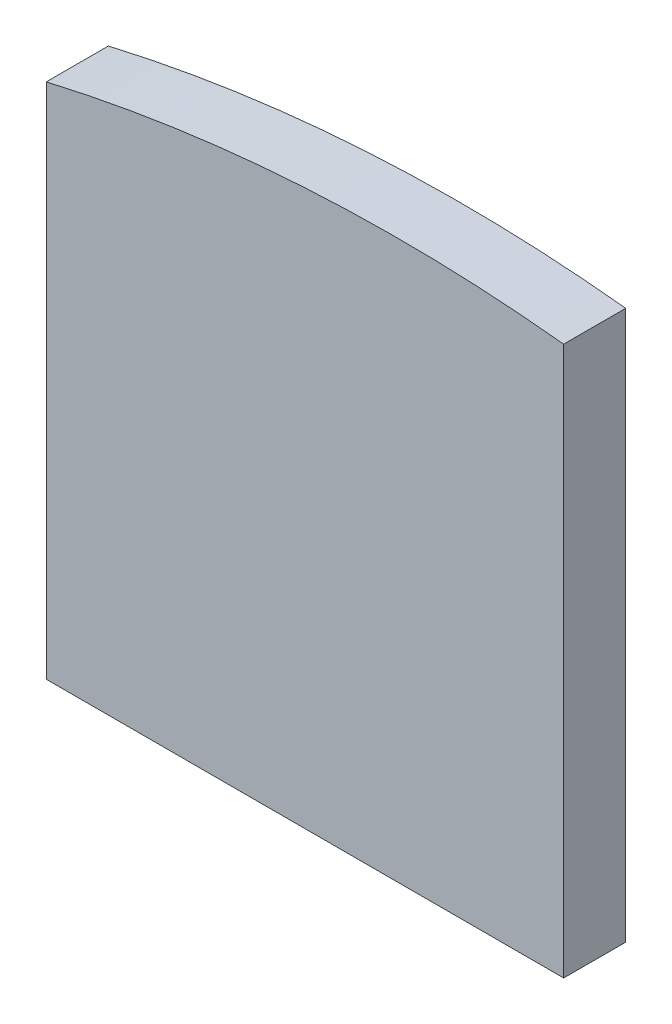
ISO-10303-21;
HEADER;
FILE_DESCRIPTION(('STEP AP214'),'2;1');
FILE_NAME('part.step','',(''),(''),'','','');
FILE_SCHEMA(('AUTOMOTIVE_DESIGN { 1 0 10303 214 1 1 1 1 }'));
ENDSEC;
DATA;
#1=APPLICATION_CONTEXT('core data for automotive mechanical design processes');
#2=APPLICATION_PROTOCOL_DEFINITION('international standard','automotive_design',2000,#1);
#3=PRODUCT_CONTEXT('',#1,'mechanical');
#4=PRODUCT('Part','Part','',(#3));
#5=PRODUCT_RELATED_PRODUCT_CATEGORY('part','',(#4));
#6=PRODUCT_DEFINITION_FORMATION('','',#4);
#7=PRODUCT_DEFINITION_CONTEXT('part definition',#1,'design');
#8=PRODUCT_DEFINITION('design','',#6,#7);
#9=PRODUCT_DEFINITION_SHAPE('','',#8);
#10=(LENGTH_UNIT() NAMED_UNIT(*) SI_UNIT(.MILLI.,.METRE.));
#11=(NAMED_UNIT(*) PLANE_ANGLE_UNIT() SI_UNIT($,.RADIAN.));
#12=(NAMED_UNIT(*) SI_UNIT($,.STERADIAN.) SOLID_ANGLE_UNIT());
#13=UNCERTAINTY_MEASURE_WITH_UNIT(LENGTH_MEASURE(1.E-05),#10,'distance_accuracy_value','');
#14=(GEOMETRIC_REPRESENTATION_CONTEXT(3) GLOBAL_UNCERTAINTY_ASSIGNED_CONTEXT((#13)) GLOBAL_UNIT_ASSIGNED_CONTEXT((#10,
#11,#12)) REPRESENTATION_CONTEXT('',''));
#15=CARTESIAN_POINT('',(0.,0.,0.));
#16=DIRECTION('',(0.,0.,1.));
#17=DIRECTION('',(1.,0.,0.));
#18=AXIS2_PLACEMENT_3D('',#15,#16,#17);
#19=CARTESIAN_POINT('',(0.,0.,12.));
#20=DIRECTION('',(0.,0.,-1.));
#21=DIRECTION('',(-1.,0.,0.));
#22=AXIS2_PLACEMENT_3D('',#19,#20,#21);
#23=CYLINDRICAL_SURFACE('',#22,300.);
#24=CARTESIAN_POINT('',(0.,0.,0.));
#25=DIRECTION('',(0.,0.,1.));
#26=DIRECTION('',(-1.,0.,0.));
#27=AXIS2_PLACEMENT_3D('',#24,#25,#26);
#28=CIRCLE('',#27,300.);
#29=CARTESIAN_POINT('',(32.,298.288451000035,0.));
#30=VERTEX_POINT('',#29);
#31=CARTESIAN_POINT('',(-68.,292.191717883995,0.));
#32=VERTEX_POINT('',#31);
#33=EDGE_CURVE('E72',#30,#32,#28,.T.);
#34=ORIENTED_EDGE('',*,*,#33,.T.);
#35=DIRECTION('',(0.,0.,-1.));
#36=VECTOR('',#35,1.);
#37=CARTESIAN_POINT('',(-68.,292.191717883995,12.));
#38=LINE('',#37,#36);
#39=CARTESIAN_POINT('',(-68.,292.191717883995,12.));
#40=VERTEX_POINT('',#39);
#41=EDGE_CURVE('E11',#40,#32,#38,.T.);
#42=ORIENTED_EDGE('',*,*,#41,.F.);
#43=CARTESIAN_POINT('',(0.,0.,12.));
#44=DIRECTION('',(0.,0.,1.));
#45=DIRECTION('',(-1.,0.,0.));
#46=AXIS2_PLACEMENT_3D('',#43,#44,#45);
#47=CIRCLE('',#46,300.);
#48=CARTESIAN_POINT('',(32.,298.288451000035,12.));
#49=VERTEX_POINT('',#48);
#50=EDGE_CURVE('E90',#49,#40,#47,.T.);
#51=ORIENTED_EDGE('',*,*,#50,.F.);
#52=DIRECTION('',(0.,0.,-1.));
#53=VECTOR('',#52,1.);
#54=CARTESIAN_POINT('',(32.,298.288451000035,12.));
#55=LINE('',#54,#53);
#56=EDGE_CURVE('E84',#49,#30,#55,.T.);
#57=ORIENTED_EDGE('',*,*,#56,.T.);
#58=EDGE_LOOP('',(#34,#42,#51,#57));
#59=FACE_BOUND('',#58,.T.);
#60=ADVANCED_FACE('F28',(#59),#23,.T.);
#61=CARTESIAN_POINT('',(-68.,292.191717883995,12.));
#62=DIRECTION('',(1.,0.,0.));
#63=DIRECTION('',(0.,1.,0.));
#64=AXIS2_PLACEMENT_3D('',#61,#62,#63);
#65=PLANE('',#64);
#66=DIRECTION('',(0.,-1.,0.));
#67=VECTOR('',#66,1.);
#68=CARTESIAN_POINT('',(-68.,292.191717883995,0.));
#69=LINE('',#68,#67);
#70=CARTESIAN_POINT('',(-68.,192.191717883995,0.));
#71=VERTEX_POINT('',#70);
#72=EDGE_CURVE('E68',#32,#71,#69,.T.);
#73=ORIENTED_EDGE('',*,*,#72,.T.);
#74=DIRECTION('',(0.,0.,-1.));
#75=VECTOR('',#74,1.);
#76=CARTESIAN_POINT('',(-68.,192.191717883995,12.));
#77=LINE('',#76,#75);
#78=CARTESIAN_POINT('',(-68.,192.191717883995,12.));
#79=VERTEX_POINT('',#78);
#80=EDGE_CURVE('E35',#79,#71,#77,.T.);
#81=ORIENTED_EDGE('',*,*,#80,.F.);
#82=DIRECTION('',(0.,-1.,0.));
#83=VECTOR('',#82,1.);
#84=CARTESIAN_POINT('',(-68.,292.191717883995,12.));
#85=LINE('',#84,#83);
#86=EDGE_CURVE('E80',#40,#79,#85,.T.);
#87=ORIENTED_EDGE('',*,*,#86,.F.);
#88=ORIENTED_EDGE('',*,*,#41,.T.);
#89=EDGE_LOOP('',(#73,#81,#87,#88));
#90=FACE_BOUND('',#89,.T.);
#91=ADVANCED_FACE('F79',(#90),#65,.F.);
#92=CARTESIAN_POINT('',(-68.,192.191717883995,12.));
#93=DIRECTION('',(0.,1.,0.));
#94=DIRECTION('',(0.,0.,1.));
#95=AXIS2_PLACEMENT_3D('',#92,#93,#94);
#96=PLANE('',#95);
#97=DIRECTION('',(1.,0.,0.));
#98=VECTOR('',#97,1.);
#99=CARTESIAN_POINT('',(-68.,192.191717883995,0.));
#100=LINE('',#99,#98);
#101=CARTESIAN_POINT('',(32.,192.191717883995,0.));
#102=VERTEX_POINT('',#101);
#103=EDGE_CURVE('E73',#71,#102,#100,.T.);
#104=ORIENTED_EDGE('',*,*,#103,.T.);
#105=DIRECTION('',(0.,0.,-1.));
#106=VECTOR('',#105,1.);
#107=CARTESIAN_POINT('',(32.,192.191717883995,12.));
#108=LINE('',#107,#106);
#109=CARTESIAN_POINT('',(32.,192.191717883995,12.));
#110=VERTEX_POINT('',#109);
#111=EDGE_CURVE('E96',#110,#102,#108,.T.);
#112=ORIENTED_EDGE('',*,*,#111,.F.);
#113=DIRECTION('',(1.,0.,0.));
#114=VECTOR('',#113,1.);
#115=CARTESIAN_POINT('',(-68.,192.191717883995,12.));
#116=LINE('',#115,#114);
#117=EDGE_CURVE('E47',#79,#110,#116,.T.);
#118=ORIENTED_EDGE('',*,*,#117,.F.);
#119=ORIENTED_EDGE('',*,*,#80,.T.);
#120=EDGE_LOOP('',(#104,#112,#118,#119));
#121=FACE_BOUND('',#120,.T.);
#122=ADVANCED_FACE('F99',(#121),#96,.F.);
#123=CARTESIAN_POINT('',(32.,192.191717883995,12.));
#124=DIRECTION('',(-1.,0.,0.));
#125=DIRECTION('',(0.,0.,1.));
#126=AXIS2_PLACEMENT_3D('',#123,#124,#125);
#127=PLANE('',#126);
#128=DIRECTION('',(0.,1.,0.));
#129=VECTOR('',#128,1.);
#130=CARTESIAN_POINT('',(32.,192.191717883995,0.));
#131=LINE('',#130,#129);
#132=EDGE_CURVE('E88',#102,#30,#131,.T.);
#133=ORIENTED_EDGE('',*,*,#132,.T.);
#134=ORIENTED_EDGE('',*,*,#56,.F.);
#135=DIRECTION('',(0.,1.,0.));
#136=VECTOR('',#135,1.);
#137=CARTESIAN_POINT('',(32.,192.191717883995,12.));
#138=LINE('',#137,#136);
#139=EDGE_CURVE('E42',#110,#49,#138,.T.);
#140=ORIENTED_EDGE('',*,*,#139,.F.);
#141=ORIENTED_EDGE('',*,*,#111,.T.);
#142=EDGE_LOOP('',(#133,#134,#140,#141));
#143=FACE_BOUND('',#142,.T.);
#144=ADVANCED_FACE('F101',(#143),#127,.F.);
#145=CARTESIAN_POINT('',(0.,0.,12.));
#146=DIRECTION('',(0.,0.,-1.));
#147=DIRECTION('',(-1.,0.,0.));
#148=AXIS2_PLACEMENT_3D('',#145,#146,#147);
#149=PLANE('',#148);
#150=ORIENTED_EDGE('',*,*,#50,.T.);
#151=ORIENTED_EDGE('',*,*,#86,.T.);
#152=ORIENTED_EDGE('',*,*,#117,.T.);
#153=ORIENTED_EDGE('',*,*,#139,.T.);
#154=EDGE_LOOP('',(#150,#151,#152,#153));
#155=FACE_BOUND('',#154,.T.);
#156=ADVANCED_FACE('F102',(#155),#149,.F.);
#157=CARTESIAN_POINT('',(0.,0.,0.));
#158=DIRECTION('',(0.,0.,-1.));
#159=DIRECTION('',(-1.,0.,0.));
#160=AXIS2_PLACEMENT_3D('',#157,#158,#159);
#161=PLANE('',#160);
#162=ORIENTED_EDGE('',*,*,#33,.F.);
#163=ORIENTED_EDGE('',*,*,#132,.F.);
#164=ORIENTED_EDGE('',*,*,#103,.F.);
#165=ORIENTED_EDGE('',*,*,#72,.F.);
#166=EDGE_LOOP('',(#162,#163,#164,#165));
#167=FACE_BOUND('',#166,.T.);
#168=ADVANCED_FACE('F69',(#167),#161,.T.);
#169=CLOSED_SHELL('',(#60,#91,#122,#144,#156,#168));
#170=MANIFOLD_SOLID_BREP('B2',#169);
#171=ADVANCED_BREP_SHAPE_REPRESENTATION('',(#18,#170),#14);
#172=SHAPE_DEFINITION_REPRESENTATION(#9,#171);
ENDSEC;
END-ISO-10303-21;
